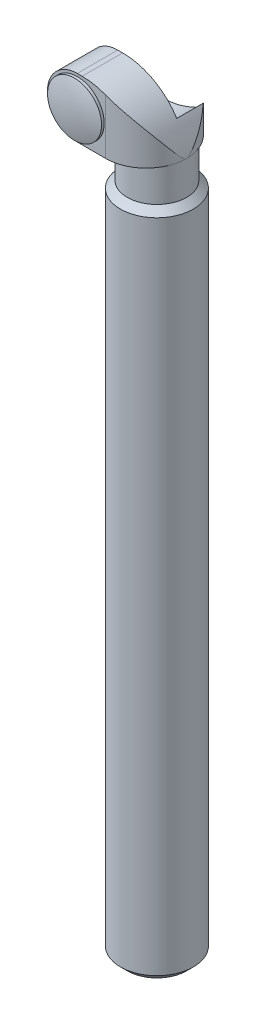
ISO-10303-21;
HEADER;
FILE_DESCRIPTION(('STEP AP214'),'2;1');
FILE_NAME('part.step','',(''),(''),'','','');
FILE_SCHEMA(('AUTOMOTIVE_DESIGN { 1 0 10303 214 1 1 1 1 }'));
ENDSEC;
DATA;
#1=APPLICATION_CONTEXT('core data for automotive mechanical design processes');
#2=APPLICATION_PROTOCOL_DEFINITION('international standard','automotive_design',2000,#1);
#3=PRODUCT_CONTEXT('',#1,'mechanical');
#4=PRODUCT('Part','Part','',(#3));
#5=PRODUCT_RELATED_PRODUCT_CATEGORY('part','',(#4));
#6=PRODUCT_DEFINITION_FORMATION('','',#4);
#7=PRODUCT_DEFINITION_CONTEXT('part definition',#1,'design');
#8=PRODUCT_DEFINITION('design','',#6,#7);
#9=PRODUCT_DEFINITION_SHAPE('','',#8);
#10=(LENGTH_UNIT() NAMED_UNIT(*) SI_UNIT(.MILLI.,.METRE.));
#11=(NAMED_UNIT(*) PLANE_ANGLE_UNIT() SI_UNIT($,.RADIAN.));
#12=(NAMED_UNIT(*) SI_UNIT($,.STERADIAN.) SOLID_ANGLE_UNIT());
#13=UNCERTAINTY_MEASURE_WITH_UNIT(LENGTH_MEASURE(1.E-05),#10,'distance_accuracy_value','');
#14=(GEOMETRIC_REPRESENTATION_CONTEXT(3) GLOBAL_UNCERTAINTY_ASSIGNED_CONTEXT((#13)) GLOBAL_UNIT_ASSIGNED_CONTEXT((#10,
#11,#12)) REPRESENTATION_CONTEXT('',''));
#15=CARTESIAN_POINT('',(0.,0.,0.));
#16=DIRECTION('',(0.,0.,1.));
#17=DIRECTION('',(1.,0.,0.));
#18=AXIS2_PLACEMENT_3D('',#15,#16,#17);
#19=CARTESIAN_POINT('',(-29.,0.,30.));
#20=DIRECTION('',(0.,0.,1.));
#21=DIRECTION('',(1.,0.,0.));
#22=AXIS2_PLACEMENT_3D('',#19,#20,#21);
#23=PLANE('',#22);
#24=DIRECTION('',(0.,1.,0.));
#25=VECTOR('',#24,1.);
#26=CARTESIAN_POINT('',(-8.,-22.,30.));
#27=LINE('',#26,#25);
#28=CARTESIAN_POINT('',(-8.,-22.,30.));
#29=VERTEX_POINT('',#28);
#30=CARTESIAN_POINT('',(-7.99999999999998,18.7097571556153,30.));
#31=VERTEX_POINT('',#30);
#32=EDGE_CURVE('E175',#29,#31,#27,.T.);
#33=ORIENTED_EDGE('',*,*,#32,.T.);
#34=CARTESIAN_POINT('',(-25.370877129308,-25.5,30.));
#35=DIRECTION('',(0.,0.,1.));
#36=DIRECTION('',(-1.,0.,0.));
#37=AXIS2_PLACEMENT_3D('',#34,#35,#36);
#38=CIRCLE('',#37,47.5);
#39=CARTESIAN_POINT('',(-25.370877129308,22.,30.));
#40=VERTEX_POINT('',#39);
#41=EDGE_CURVE('E200',#31,#40,#38,.T.);
#42=ORIENTED_EDGE('',*,*,#41,.T.);
#43=DIRECTION('',(-1.,0.,0.));
#44=VECTOR('',#43,1.);
#45=CARTESIAN_POINT('',(-29.,22.,30.));
#46=LINE('',#45,#44);
#47=CARTESIAN_POINT('',(-29.,22.,30.));
#48=VERTEX_POINT('',#47);
#49=EDGE_CURVE('E118',#40,#48,#46,.T.);
#50=ORIENTED_EDGE('',*,*,#49,.T.);
#51=CARTESIAN_POINT('',(-29.,0.,30.));
#52=DIRECTION('',(0.,0.,1.));
#53=DIRECTION('',(1.,0.,0.));
#54=AXIS2_PLACEMENT_3D('',#51,#52,#53);
#55=CIRCLE('',#54,22.);
#56=CARTESIAN_POINT('',(-29.,-22.,30.));
#57=VERTEX_POINT('',#56);
#58=EDGE_CURVE('E194',#48,#57,#55,.T.);
#59=ORIENTED_EDGE('',*,*,#58,.T.);
#60=DIRECTION('',(1.,0.,0.));
#61=VECTOR('',#60,1.);
#62=CARTESIAN_POINT('',(-29.,-22.,30.));
#63=LINE('',#62,#61);
#64=EDGE_CURVE('E197',#57,#29,#63,.T.);
#65=ORIENTED_EDGE('',*,*,#64,.T.);
#66=EDGE_LOOP('',(#33,#42,#50,#59,#65));
#67=FACE_BOUND('',#66,.T.);
#68=CARTESIAN_POINT('',(-29.,0.,30.));
#69=DIRECTION('',(0.,0.,1.));
#70=DIRECTION('',(1.,0.,0.));
#71=AXIS2_PLACEMENT_3D('',#68,#69,#70);
#72=CIRCLE('',#71,20.);
#73=CARTESIAN_POINT('',(-8.99999999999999,0.,30.));
#74=VERTEX_POINT('',#73);
#75=EDGE_CURVE('E227',#74,#74,#72,.T.);
#76=ORIENTED_EDGE('',*,*,#75,.F.);
#77=EDGE_LOOP('',(#76));
#78=FACE_BOUND('',#77,.T.);
#79=ADVANCED_FACE('F32',(#67,#78),#23,.T.);
#80=CARTESIAN_POINT('',(-29.,-22.,30.));
#81=DIRECTION('',(0.,1.,0.));
#82=DIRECTION('',(-1.,0.,0.));
#83=AXIS2_PLACEMENT_3D('',#80,#81,#82);
#84=PLANE('',#83);
#85=DIRECTION('',(0.,0.,1.));
#86=VECTOR('',#85,1.);
#87=CARTESIAN_POINT('',(-25.370877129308,-22.,-30.));
#88=LINE('',#87,#86);
#89=CARTESIAN_POINT('',(-25.370877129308,-22.,-30.));
#90=VERTEX_POINT('',#89);
#91=CARTESIAN_POINT('',(-25.370877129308,-22.,0.));
#92=VERTEX_POINT('',#91);
#93=EDGE_CURVE('E218',#90,#92,#88,.T.);
#94=ORIENTED_EDGE('',*,*,#93,.F.);
#95=DIRECTION('',(1.,0.,0.));
#96=VECTOR('',#95,1.);
#97=CARTESIAN_POINT('',(-29.,-22.,-30.));
#98=LINE('',#97,#96);
#99=CARTESIAN_POINT('',(-7.99999999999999,-22.,-30.));
#100=VERTEX_POINT('',#99);
#101=EDGE_CURVE('E55',#90,#100,#98,.T.);
#102=ORIENTED_EDGE('',*,*,#101,.T.);
#103=CARTESIAN_POINT('',(-8.,-22.,0.));
#104=DIRECTION('',(0.,-1.,0.));
#105=DIRECTION('',(1.,0.,0.));
#106=AXIS2_PLACEMENT_3D('',#103,#104,#105);
#107=CIRCLE('',#106,30.);
#108=CARTESIAN_POINT('',(22.,-22.,0.));
#109=VERTEX_POINT('',#108);
#110=EDGE_CURVE('E209',#100,#109,#107,.T.);
#111=ORIENTED_EDGE('',*,*,#110,.T.);
#112=CARTESIAN_POINT('',(0.,-22.,0.));
#113=DIRECTION('',(0.,1.,0.));
#114=DIRECTION('',(-1.,0.,0.));
#115=AXIS2_PLACEMENT_3D('',#112,#113,#114);
#116=CIRCLE('',#115,22.);
#117=EDGE_CURVE('E178',#109,#109,#116,.T.);
#118=ORIENTED_EDGE('',*,*,#117,.T.);
#119=EDGE_CURVE('E207',#109,#29,#107,.T.);
#120=ORIENTED_EDGE('',*,*,#119,.T.);
#121=ORIENTED_EDGE('',*,*,#64,.F.);
#122=DIRECTION('',(0.,0.,-1.));
#123=VECTOR('',#122,1.);
#124=CARTESIAN_POINT('',(-29.,-22.,30.));
#125=LINE('',#124,#123);
#126=CARTESIAN_POINT('',(-29.,-22.,0.));
#127=VERTEX_POINT('',#126);
#128=EDGE_CURVE('E41',#57,#127,#125,.T.);
#129=ORIENTED_EDGE('',*,*,#128,.T.);
#130=DIRECTION('',(1.,0.,0.));
#131=VECTOR('',#130,1.);
#132=CARTESIAN_POINT('',(-29.,-22.,0.));
#133=LINE('',#132,#131);
#134=EDGE_CURVE('E205',#127,#92,#133,.T.);
#135=ORIENTED_EDGE('',*,*,#134,.T.);
#136=EDGE_LOOP('',(#94,#102,#111,#118,#120,#121,#129,#135));
#137=FACE_BOUND('',#136,.T.);
#138=ADVANCED_FACE('F149',(#137),#84,.F.);
#139=CARTESIAN_POINT('',(-29.,0.,30.));
#140=DIRECTION('',(0.,0.,-1.));
#141=DIRECTION('',(-1.,0.,0.));
#142=AXIS2_PLACEMENT_3D('',#139,#140,#141);
#143=CYLINDRICAL_SURFACE('',#142,22.);
#144=DIRECTION('',(0.,0.,-1.));
#145=VECTOR('',#144,1.);
#146=CARTESIAN_POINT('',(-29.,22.,30.));
#147=LINE('',#146,#145);
#148=CARTESIAN_POINT('',(-29.,22.,0.));
#149=VERTEX_POINT('',#148);
#150=EDGE_CURVE('E119',#48,#149,#147,.T.);
#151=ORIENTED_EDGE('',*,*,#150,.T.);
#152=CARTESIAN_POINT('',(-29.,0.,0.));
#153=DIRECTION('',(0.,0.,1.));
#154=DIRECTION('',(1.,0.,0.));
#155=AXIS2_PLACEMENT_3D('',#152,#153,#154);
#156=CIRCLE('',#155,22.);
#157=EDGE_CURVE('E101',#149,#127,#156,.T.);
#158=ORIENTED_EDGE('',*,*,#157,.T.);
#159=ORIENTED_EDGE('',*,*,#128,.F.);
#160=ORIENTED_EDGE('',*,*,#58,.F.);
#161=EDGE_LOOP('',(#151,#158,#159,#160));
#162=FACE_BOUND('',#161,.T.);
#163=ADVANCED_FACE('F155',(#162),#143,.T.);
#164=CARTESIAN_POINT('',(-25.370877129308,-25.5,30.));
#165=DIRECTION('',(0.,0.,-1.));
#166=DIRECTION('',(-1.,0.,0.));
#167=AXIS2_PLACEMENT_3D('',#164,#165,#166);
#168=CYLINDRICAL_SURFACE('',#167,47.5);
#169=CARTESIAN_POINT('',(-7.99999999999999,18.7097571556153,30.));
#170=CARTESIAN_POINT('',(-7.56651433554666,18.5394487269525,30.0000097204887));
#171=CARTESIAN_POINT('',(-7.1355781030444,18.362749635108,29.990605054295));
#172=CARTESIAN_POINT('',(-6.27980889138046,17.9970941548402,29.9537005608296));
#173=CARTESIAN_POINT('',(-5.85497483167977,17.8081399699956,29.9262039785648));
#174=CARTESIAN_POINT('',(-5.01290872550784,17.4187377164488,29.8539045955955));
#175=CARTESIAN_POINT('',(-4.59566595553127,17.2183078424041,29.8091285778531));
#176=CARTESIAN_POINT('',(-3.76890543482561,16.8062437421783,29.7030569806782));
#177=CARTESIAN_POINT('',(-3.35938802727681,16.5946090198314,29.6417606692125));
#178=CARTESIAN_POINT('',(-2.15202468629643,15.9483015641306,29.4357404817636));
#179=CARTESIAN_POINT('',(-1.36627834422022,15.4980098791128,29.268070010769));
#180=CARTESIAN_POINT('',(0.168412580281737,14.5600132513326,28.8774098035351));
#181=CARTESIAN_POINT('',(0.917338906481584,14.0722900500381,28.6543929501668));
#182=CARTESIAN_POINT('',(2.5531621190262,12.9410274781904,28.0988857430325));
#183=CARTESIAN_POINT('',(3.42927347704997,12.2884563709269,27.7529618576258));
#184=CARTESIAN_POINT('',(5.11749358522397,10.9400505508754,26.9960676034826));
#185=CARTESIAN_POINT('',(5.92959315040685,10.2442096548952,26.5850879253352));
#186=CARTESIAN_POINT('',(7.49285473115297,8.81259008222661,25.705633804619));
#187=CARTESIAN_POINT('',(8.24369978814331,8.07663296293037,25.2368883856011));
#188=CARTESIAN_POINT('',(9.68040760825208,6.57395304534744,24.2520491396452));
#189=CARTESIAN_POINT('',(10.3662666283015,5.80722847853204,23.7359525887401));
#190=CARTESIAN_POINT('',(11.9300216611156,3.94309939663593,22.453913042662));
#191=CARTESIAN_POINT('',(12.7782202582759,2.83356125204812,21.6691497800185));
#192=CARTESIAN_POINT('',(13.9610019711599,1.14071491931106,20.4459341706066));
#193=CARTESIAN_POINT('',(14.3404573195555,0.571477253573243,20.0303675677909));
#194=CARTESIAN_POINT('',(15.0701504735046,-0.575410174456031,19.1854034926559));
#195=CARTESIAN_POINT('',(15.420388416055,-1.15305989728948,18.7560060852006));
#196=CARTESIAN_POINT('',(16.4271284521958,-2.89526047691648,17.4505721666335));
#197=CARTESIAN_POINT('',(17.0409444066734,-4.0709185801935,16.5559483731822));
#198=CARTESIAN_POINT('',(17.8788126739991,-5.84946117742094,15.1846539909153));
#199=CARTESIAN_POINT('',(18.1442648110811,-6.44474259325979,14.722722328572));
#200=CARTESIAN_POINT('',(18.6481619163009,-7.63958107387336,13.7897254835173));
#201=CARTESIAN_POINT('',(18.8866076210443,-8.23913802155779,13.3186605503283));
#202=CARTESIAN_POINT('',(19.4348396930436,-9.70297471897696,12.1613875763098));
#203=CARTESIAN_POINT('',(19.7305689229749,-10.5690135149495,11.4706872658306));
#204=CARTESIAN_POINT('',(20.1339114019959,-11.8702367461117,10.4222411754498));
#205=CARTESIAN_POINT('',(20.2616448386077,-12.3043164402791,10.070711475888));
#206=CARTESIAN_POINT('',(20.5038360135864,-13.1726366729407,9.36328408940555));
#207=CARTESIAN_POINT('',(20.6182936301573,-13.606877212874,9.00738636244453));
#208=CARTESIAN_POINT('',(20.8756491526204,-14.642172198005,8.15267084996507));
#209=CARTESIAN_POINT('',(21.0124862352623,-15.2429587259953,7.65168036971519));
#210=CARTESIAN_POINT('',(21.1987780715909,-16.1399604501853,6.89195452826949));
#211=CARTESIAN_POINT('',(21.2576644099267,-16.4379635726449,6.63760221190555));
#212=CARTESIAN_POINT('',(21.3691969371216,-17.0320158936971,6.12527867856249));
#213=CARTESIAN_POINT('',(21.4218433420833,-17.3280651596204,5.86730758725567));
#214=CARTESIAN_POINT('',(21.5346196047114,-17.9986796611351,5.27454582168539));
#215=CARTESIAN_POINT('',(21.5927807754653,-18.3722699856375,4.93827638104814));
#216=CARTESIAN_POINT('',(21.6992110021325,-19.1127530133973,4.25192076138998));
#217=CARTESIAN_POINT('',(21.747413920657,-19.4795870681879,3.90175953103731));
#218=CARTESIAN_POINT('',(21.8119658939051,-20.0170583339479,3.35860630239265));
#219=CARTESIAN_POINT('',(21.832286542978,-20.1950858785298,3.17343622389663));
#220=CARTESIAN_POINT('',(21.8701342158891,-20.5434422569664,2.794893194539));
#221=CARTESIAN_POINT('',(21.8876555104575,-20.7137548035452,2.60150442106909));
#222=CARTESIAN_POINT('',(21.9194864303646,-21.0392872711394,2.20534221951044));
#223=CARTESIAN_POINT('',(21.9338268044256,-21.1946426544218,2.00268376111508));
#224=CARTESIAN_POINT('',(21.9590429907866,-21.4814199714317,1.5811895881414));
#225=CARTESIAN_POINT('',(21.9699344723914,-21.6129489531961,1.36243277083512));
#226=CARTESIAN_POINT('',(21.9837749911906,-21.7863358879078,0.995881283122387));
#227=CARTESIAN_POINT('',(21.9881533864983,-21.8429202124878,0.85533096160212));
#228=CARTESIAN_POINT('',(21.9949833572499,-21.9324673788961,0.567099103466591));
#229=CARTESIAN_POINT('',(21.9974427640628,-21.9655261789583,0.419449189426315));
#230=CARTESIAN_POINT('',(22.0001466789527,-22.0019239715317,0.118381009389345));
#231=CARTESIAN_POINT('',(22.0003631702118,-22.0048870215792,-0.0350862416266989));
#232=CARTESIAN_POINT('',(21.9984675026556,-21.9793046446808,-0.339504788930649));
#233=CARTESIAN_POINT('',(21.9963500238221,-21.9506872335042,-0.490449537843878));
#234=CARTESIAN_POINT('',(21.9893426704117,-21.8582881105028,-0.820270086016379));
#235=CARTESIAN_POINT('',(21.9839083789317,-21.787703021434,-0.997129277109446));
#236=CARTESIAN_POINT('',(21.9706034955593,-21.6216987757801,-1.33878747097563));
#237=CARTESIAN_POINT('',(21.9627231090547,-21.5261800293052,-1.50353463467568));
#238=CARTESIAN_POINT('',(21.9384457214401,-21.2444524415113,-1.9409122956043));
#239=CARTESIAN_POINT('',(21.9200528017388,-21.0432950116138,-2.20354789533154));
#240=CARTESIAN_POINT('',(21.8782979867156,-20.6202954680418,-2.7114537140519));
#241=CARTESIAN_POINT('',(21.8549210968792,-20.3983920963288,-2.95666848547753));
#242=CARTESIAN_POINT('',(21.8034022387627,-19.942088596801,-3.43742704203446));
#243=CARTESIAN_POINT('',(21.7752327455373,-19.7076219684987,-3.67290460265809));
#244=CARTESIAN_POINT('',(21.7144260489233,-19.2324943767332,-4.13609641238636));
#245=CARTESIAN_POINT('',(21.681795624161,-18.9918432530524,-4.36382179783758));
#246=CARTESIAN_POINT('',(21.6124179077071,-18.5086468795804,-4.81202947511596));
#247=CARTESIAN_POINT('',(21.5757114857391,-18.2661397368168,-5.03255927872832));
#248=CARTESIAN_POINT('',(21.4979657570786,-17.7784327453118,-5.46985268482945));
#249=CARTESIAN_POINT('',(21.4569262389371,-17.5332327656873,-5.68661610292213));
#250=CARTESIAN_POINT('',(21.327307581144,-16.7948813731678,-6.33263325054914));
#251=CARTESIAN_POINT('',(21.23223937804,-16.2990559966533,-6.75754322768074));
#252=CARTESIAN_POINT('',(21.0246500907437,-15.3037208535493,-7.59985308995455));
#253=CARTESIAN_POINT('',(20.912108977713,-14.8042074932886,-8.01724373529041));
#254=CARTESIAN_POINT('',(20.6695491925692,-13.8041083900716,-8.84551530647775));
#255=CARTESIAN_POINT('',(20.5395321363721,-13.3035227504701,-9.25639683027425));
#256=CARTESIAN_POINT('',(20.2622292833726,-12.3038653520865,-10.0713009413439));
#257=CARTESIAN_POINT('',(20.1149904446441,-11.8047931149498,-10.475338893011));
#258=CARTESIAN_POINT('',(19.8027933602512,-10.8077420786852,-11.2778552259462));
#259=CARTESIAN_POINT('',(19.6378348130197,-10.3097632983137,-11.6763335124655));
#260=CARTESIAN_POINT('',(19.1161909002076,-8.81890038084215,-12.8630936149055));
#261=CARTESIAN_POINT('',(18.7326056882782,-7.82861250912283,-13.6430884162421));
#262=CARTESIAN_POINT('',(18.0501654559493,-6.23063019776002,-14.8891363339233));
#263=CARTESIAN_POINT('',(17.7737582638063,-5.61921982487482,-15.3628563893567));
#264=CARTESIAN_POINT('',(17.1918194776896,-4.40208764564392,-16.2995801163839));
#265=CARTESIAN_POINT('',(16.8862869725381,-3.79636601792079,-16.7625834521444));
#266=CARTESIAN_POINT('',(15.9248222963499,-1.98875820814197,-18.1342348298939));
#267=CARTESIAN_POINT('',(15.22413502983,-0.796693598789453,-19.025317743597));
#268=CARTESIAN_POINT('',(14.080666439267,0.963467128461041,-20.3168513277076));
#269=CARTESIAN_POINT('',(13.6841269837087,1.54550179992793,-20.7398265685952));
#270=CARTESIAN_POINT('',(12.8595257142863,2.69909858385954,-21.569009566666));
#271=CARTESIAN_POINT('',(12.4314626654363,3.27066028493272,-21.9752166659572));
#272=CARTESIAN_POINT('',(11.0995658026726,4.9667297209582,-23.1651360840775));
#273=CARTESIAN_POINT('',(10.1472862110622,6.07376735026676,-23.9209907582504));
#274=CARTESIAN_POINT('',(8.51158018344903,7.80220969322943,-25.0586057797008));
#275=CARTESIAN_POINT('',(7.8696604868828,8.44341721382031,-25.4706040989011));
#276=CARTESIAN_POINT('',(6.53680472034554,9.69925774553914,-26.2541179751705));
#277=CARTESIAN_POINT('',(5.84587424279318,10.3138937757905,-26.6256381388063));
#278=CARTESIAN_POINT('',(4.41787795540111,11.5100596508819,-27.3207734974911));
#279=CARTESIAN_POINT('',(3.68098884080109,12.0917016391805,-27.6445577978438));
#280=CARTESIAN_POINT('',(2.15994560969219,13.2194989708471,-28.2390138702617));
#281=CARTESIAN_POINT('',(1.37579569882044,13.7656574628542,-28.509690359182));
#282=CARTESIAN_POINT('',(-0.0893003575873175,14.7207704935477,-28.9463868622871));
#283=CARTESIAN_POINT('',(-0.762822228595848,15.1365259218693,-29.1224958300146));
#284=CARTESIAN_POINT('',(-2.13742470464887,15.9377707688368,-29.4300145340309));
#285=CARTESIAN_POINT('',(-2.83849538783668,16.3232709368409,-29.561440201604));
#286=CARTESIAN_POINT('',(-3.91114854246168,16.8779901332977,-29.7222730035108));
#287=CARTESIAN_POINT('',(-4.27368781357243,17.0596477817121,-29.7699489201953));
#288=CARTESIAN_POINT('',(-5.00450980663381,17.4141696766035,-29.8523403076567));
#289=CARTESIAN_POINT('',(-5.37279235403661,17.5870341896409,-29.887056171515));
#290=CARTESIAN_POINT('',(-6.11493402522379,17.9237818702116,-29.9430314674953));
#291=CARTESIAN_POINT('',(-6.48879872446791,18.0876551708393,-29.964276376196));
#292=CARTESIAN_POINT('',(-7.24112326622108,18.4059118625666,-29.9927644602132));
#293=CARTESIAN_POINT('',(-7.61958365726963,18.5602941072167,-30.0000059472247));
#294=CARTESIAN_POINT('',(-7.99999999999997,18.7097571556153,-30.));
#295=B_SPLINE_CURVE_WITH_KNOTS('',3,(#169,#170,#171,#172,#173,#174,#175,#176,#177,#178,#179,
#180,#181,#182,#183,#184,#185,#186,#187,#188,#189,#190,#191,#192,#193,#194,#195,#196,#197,#198,
#199,#200,#201,#202,#203,#204,#205,#206,#207,#208,#209,#210,#211,#212,#213,#214,#215,#216,#217,
#218,#219,#220,#221,#222,#223,#224,#225,#226,#227,#228,#229,#230,#231,#232,#233,#234,#235,#236,
#237,#238,#239,#240,#241,#242,#243,#244,#245,#246,#247,#248,#249,#250,#251,#252,#253,#254,#255,
#256,#257,#258,#259,#260,#261,#262,#263,#264,#265,#266,#267,#268,#269,#270,#271,#272,#273,#274,
#275,#276,#277,#278,#279,#280,#281,#282,#283,#284,#285,#286,#287,#288,#289,#290,#291,#292,#293,
#294),.UNSPECIFIED.,.F.,.F.,(4,2,2,2,2,2,2,2,2,2,2,2,2,2,2,2,2,2,2,2,2,2,2,2,2,2,2,2,2,2,2,2,2,
2,2,2,2,2,2,2,2,2,2,2,2,2,2,2,2,2,2,2,2,2,2,2,2,2,2,2,2,2,4),(0.,1.39702311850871,
2.79379573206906,4.18841200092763,5.58309007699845,8.34239851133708,11.1030615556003,
14.5356517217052,17.9687335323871,21.4185809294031,24.8686269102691,29.6669298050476,
32.0677195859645,34.4684981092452,39.2621903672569,41.6584374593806,44.0546191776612,
47.4926192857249,49.2114437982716,50.9302840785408,53.3121675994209,54.5006931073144,
55.6891774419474,57.2069868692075,58.7345738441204,59.5074392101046,60.2818666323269,
61.048445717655,61.8114903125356,62.2647675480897,62.7161851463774,63.1732348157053,
63.6313284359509,64.1996278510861,64.7702328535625,65.7614555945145,66.7557036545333,
67.7558675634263,68.7545282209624,69.7439519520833,70.7334239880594,72.712684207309,
74.6942301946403,76.6755930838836,78.6516741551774,80.627788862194,84.5781346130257,
87.0416653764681,89.5052732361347,94.4335475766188,96.897428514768,99.3614060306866,
104.284569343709,107.272032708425,110.259155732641,113.235428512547,116.211436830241,
118.64202426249,121.071744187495,122.296357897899,123.520934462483,124.746829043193,
125.972871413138),.UNSPECIFIED.);
#296=CARTESIAN_POINT('',(14.7040526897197,0.,-19.609334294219));
#297=VERTEX_POINT('',#296);
#298=EDGE_CURVE('E168',#109,#297,#295,.T.);
#299=ORIENTED_EDGE('',*,*,#298,.T.);
#300=DIRECTION('',(0.,0.,1.));
#301=VECTOR('',#300,1.);
#302=CARTESIAN_POINT('',(14.7040526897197,0.,-30.));
#303=LINE('',#302,#301);
#304=CARTESIAN_POINT('',(14.7040526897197,0.,0.));
#305=VERTEX_POINT('',#304);
#306=EDGE_CURVE('E48',#297,#305,#303,.T.);
#307=ORIENTED_EDGE('',*,*,#306,.T.);
#308=CARTESIAN_POINT('',(-25.370877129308,-25.5,0.));
#309=DIRECTION('',(0.,0.,1.));
#310=DIRECTION('',(1.,0.,0.));
#311=AXIS2_PLACEMENT_3D('',#308,#309,#310);
#312=CIRCLE('',#311,47.5);
#313=CARTESIAN_POINT('',(-25.370877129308,22.,0.));
#314=VERTEX_POINT('',#313);
#315=EDGE_CURVE('E99',#305,#314,#312,.T.);
#316=ORIENTED_EDGE('',*,*,#315,.T.);
#317=DIRECTION('',(0.,0.,-1.));
#318=VECTOR('',#317,1.);
#319=CARTESIAN_POINT('',(-25.370877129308,22.,30.));
#320=LINE('',#319,#318);
#321=EDGE_CURVE('E112',#40,#314,#320,.T.);
#322=ORIENTED_EDGE('',*,*,#321,.F.);
#323=ORIENTED_EDGE('',*,*,#41,.F.);
#324=EDGE_CURVE('E174',#31,#109,#295,.T.);
#325=ORIENTED_EDGE('',*,*,#324,.T.);
#326=EDGE_LOOP('',(#299,#307,#316,#322,#323,#325));
#327=FACE_BOUND('',#326,.T.);
#328=ADVANCED_FACE('F110',(#327),#168,.T.);
#329=CARTESIAN_POINT('',(-29.,22.,30.));
#330=DIRECTION('',(0.,-1.,0.));
#331=DIRECTION('',(0.,0.,-1.));
#332=AXIS2_PLACEMENT_3D('',#329,#330,#331);
#333=PLANE('',#332);
#334=ORIENTED_EDGE('',*,*,#321,.T.);
#335=DIRECTION('',(-1.,0.,0.));
#336=VECTOR('',#335,1.);
#337=CARTESIAN_POINT('',(-25.370877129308,22.,0.));
#338=LINE('',#337,#336);
#339=EDGE_CURVE('E96',#314,#149,#338,.T.);
#340=ORIENTED_EDGE('',*,*,#339,.T.);
#341=ORIENTED_EDGE('',*,*,#150,.F.);
#342=ORIENTED_EDGE('',*,*,#49,.F.);
#343=EDGE_LOOP('',(#334,#340,#341,#342));
#344=FACE_BOUND('',#343,.T.);
#345=ADVANCED_FACE('F117',(#344),#333,.F.);
#346=CARTESIAN_POINT('',(-29.,0.,-30.));
#347=DIRECTION('',(0.,0.,1.));
#348=DIRECTION('',(1.,0.,0.));
#349=AXIS2_PLACEMENT_3D('',#346,#347,#348);
#350=PLANE('',#349);
#351=ORIENTED_EDGE('',*,*,#101,.F.);
#352=CARTESIAN_POINT('',(-25.370877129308,25.5,-30.));
#353=DIRECTION('',(0.,0.,1.));
#354=DIRECTION('',(-1.,0.,0.));
#355=AXIS2_PLACEMENT_3D('',#352,#353,#354);
#356=CIRCLE('',#355,47.5);
#357=CARTESIAN_POINT('',(-8.,-18.7097571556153,-30.));
#358=VERTEX_POINT('',#357);
#359=EDGE_CURVE('E114',#90,#358,#356,.T.);
#360=ORIENTED_EDGE('',*,*,#359,.T.);
#361=DIRECTION('',(0.,1.,0.));
#362=VECTOR('',#361,1.);
#363=CARTESIAN_POINT('',(-8.00000000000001,-22.,-30.));
#364=LINE('',#363,#362);
#365=EDGE_CURVE('E176',#100,#358,#364,.T.);
#366=ORIENTED_EDGE('',*,*,#365,.F.);
#367=EDGE_LOOP('',(#351,#360,#366));
#368=FACE_BOUND('',#367,.T.);
#369=ADVANCED_FACE('F161',(#368),#350,.F.);
#370=CARTESIAN_POINT('',(22.0000000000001,-543.,0.));
#371=DIRECTION('',(0.,1.,0.));
#372=DIRECTION('',(-1.,0.,0.));
#373=AXIS2_PLACEMENT_3D('',#370,#371,#372);
#374=PLANE('',#373);
#375=CARTESIAN_POINT('',(0.,-543.,0.));
#376=DIRECTION('',(0.,1.,0.));
#377=DIRECTION('',(-1.,0.,0.));
#378=AXIS2_PLACEMENT_3D('',#375,#376,#377);
#379=CIRCLE('',#378,22.);
#380=CARTESIAN_POINT('',(-21.9999999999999,-543.,0.));
#381=VERTEX_POINT('',#380);
#382=EDGE_CURVE('E190',#381,#381,#379,.T.);
#383=ORIENTED_EDGE('',*,*,#382,.F.);
#384=EDGE_LOOP('',(#383));
#385=FACE_BOUND('',#384,.T.);
#386=ADVANCED_FACE('F254',(#385),#374,.F.);
#387=CARTESIAN_POINT('',(0.,-543.,0.));
#388=DIRECTION('',(0.,1.,0.));
#389=DIRECTION('',(-1.,0.,0.));
#390=AXIS2_PLACEMENT_3D('',#387,#388,#389);
#391=CONICAL_SURFACE('',#390,22.,0.785398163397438);
#392=CARTESIAN_POINT('',(0.,-538.,0.));
#393=DIRECTION('',(0.,1.,0.));
#394=DIRECTION('',(-1.,0.,0.));
#395=AXIS2_PLACEMENT_3D('',#392,#393,#394);
#396=CIRCLE('',#395,27.);
#397=CARTESIAN_POINT('',(-26.9999999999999,-538.,0.));
#398=VERTEX_POINT('',#397);
#399=EDGE_CURVE('E187',#398,#398,#396,.T.);
#400=ORIENTED_EDGE('',*,*,#399,.F.);
#401=EDGE_LOOP('',(#400));
#402=FACE_BOUND('',#401,.T.);
#403=ORIENTED_EDGE('',*,*,#382,.T.);
#404=EDGE_LOOP('',(#403));
#405=FACE_BOUND('',#404,.T.);
#406=ADVANCED_FACE('F251',(#402,#405),#391,.T.);
#407=CARTESIAN_POINT('',(0.,22.74636757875,0.));
#408=DIRECTION('',(0.,1.,0.));
#409=DIRECTION('',(-1.,0.,0.));
#410=AXIS2_PLACEMENT_3D('',#407,#408,#409);
#411=CYLINDRICAL_SURFACE('',#410,27.);
#412=CARTESIAN_POINT('',(0.,-52.,0.));
#413=DIRECTION('',(0.,1.,0.));
#414=DIRECTION('',(-1.,0.,0.));
#415=AXIS2_PLACEMENT_3D('',#412,#413,#414);
#416=CIRCLE('',#415,27.);
#417=CARTESIAN_POINT('',(-27.,-52.,0.));
#418=VERTEX_POINT('',#417);
#419=EDGE_CURVE('E184',#418,#418,#416,.T.);
#420=ORIENTED_EDGE('',*,*,#419,.F.);
#421=EDGE_LOOP('',(#420));
#422=FACE_BOUND('',#421,.T.);
#423=ORIENTED_EDGE('',*,*,#399,.T.);
#424=EDGE_LOOP('',(#423));
#425=FACE_BOUND('',#424,.T.);
#426=ADVANCED_FACE('F244',(#422,#425),#411,.T.);
#427=CARTESIAN_POINT('',(0.,-52.,0.));
#428=DIRECTION('',(0.,-1.,0.));
#429=DIRECTION('',(1.,0.,0.));
#430=AXIS2_PLACEMENT_3D('',#427,#428,#429);
#431=CONICAL_SURFACE('',#430,27.,0.785398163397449);
#432=CARTESIAN_POINT('',(0.,-47.,0.));
#433=DIRECTION('',(0.,1.,0.));
#434=DIRECTION('',(-1.,0.,0.));
#435=AXIS2_PLACEMENT_3D('',#432,#433,#434);
#436=CIRCLE('',#435,22.);
#437=CARTESIAN_POINT('',(-22.,-47.,0.));
#438=VERTEX_POINT('',#437);
#439=EDGE_CURVE('E181',#438,#438,#436,.T.);
#440=ORIENTED_EDGE('',*,*,#439,.F.);
#441=EDGE_LOOP('',(#440));
#442=FACE_BOUND('',#441,.T.);
#443=ORIENTED_EDGE('',*,*,#419,.T.);
#444=EDGE_LOOP('',(#443));
#445=FACE_BOUND('',#444,.T.);
#446=ADVANCED_FACE('F239',(#442,#445),#431,.T.);
#447=CARTESIAN_POINT('',(0.,22.74636757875,0.));
#448=DIRECTION('',(0.,1.,0.));
#449=DIRECTION('',(-1.,0.,0.));
#450=AXIS2_PLACEMENT_3D('',#447,#448,#449);
#451=CYLINDRICAL_SURFACE('',#450,22.);
#452=ORIENTED_EDGE('',*,*,#117,.F.);
#453=EDGE_LOOP('',(#452));
#454=FACE_BOUND('',#453,.T.);
#455=ORIENTED_EDGE('',*,*,#439,.T.);
#456=EDGE_LOOP('',(#455));
#457=FACE_BOUND('',#456,.T.);
#458=ADVANCED_FACE('F234',(#454,#457),#451,.T.);
#459=CARTESIAN_POINT('',(-8.,-22.,0.));
#460=DIRECTION('',(0.,1.,0.));
#461=DIRECTION('',(-1.,0.,0.));
#462=AXIS2_PLACEMENT_3D('',#459,#460,#461);
#463=CYLINDRICAL_SURFACE('',#462,30.);
#464=ORIENTED_EDGE('',*,*,#365,.T.);
#465=CARTESIAN_POINT('',(-7.99999999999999,-18.7097571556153,-30.));
#466=CARTESIAN_POINT('',(-7.56658807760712,-18.5394776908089,-30.0000097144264));
#467=CARTESIAN_POINT('',(-7.13572470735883,-18.3628097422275,-29.9906082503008));
#468=CARTESIAN_POINT('',(-6.28009896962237,-17.9972206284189,-29.9537161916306));
#469=CARTESIAN_POINT('',(-5.85533552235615,-17.8083016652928,-29.9262288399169));
#470=CARTESIAN_POINT('',(-5.01339853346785,-17.4189693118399,-29.8539527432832));
#471=CARTESIAN_POINT('',(-4.59621442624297,-17.2185738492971,-29.8091903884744));
#472=CARTESIAN_POINT('',(-3.76956857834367,-16.8065816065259,-29.7031506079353));
#473=CARTESIAN_POINT('',(-3.36010718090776,-16.5949843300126,-29.6418724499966));
#474=CARTESIAN_POINT('',(-2.1526499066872,-15.9486553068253,-29.4358687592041));
#475=CARTESIAN_POINT('',(-1.36675984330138,-15.4982952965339,-29.2681829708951));
#476=CARTESIAN_POINT('',(0.168189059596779,-14.5601587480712,-28.8774763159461));
#477=CARTESIAN_POINT('',(0.917230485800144,-14.0723647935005,-28.6544295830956));
#478=CARTESIAN_POINT('',(2.55322538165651,-12.9409840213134,-28.0988644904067));
#479=CARTESIAN_POINT('',(3.42939449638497,-12.288367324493,-27.7529149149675));
#480=CARTESIAN_POINT('',(5.11779458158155,-10.9398025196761,-26.9959253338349));
#481=CARTESIAN_POINT('',(5.93001137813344,-10.2438448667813,-26.584870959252));
#482=CARTESIAN_POINT('',(7.4933750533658,-8.81209525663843,-25.7053226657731));
#483=CARTESIAN_POINT('',(8.24421177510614,-8.07612894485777,-25.2365638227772));
#484=CARTESIAN_POINT('',(9.68079322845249,-6.57351821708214,-24.2517583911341));
#485=CARTESIAN_POINT('',(10.3665535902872,-5.80688123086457,-23.7357232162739));
#486=CARTESIAN_POINT('',(11.3627329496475,-4.61935852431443,-22.9189997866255));
#487=CARTESIAN_POINT('',(11.6963563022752,-4.20770924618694,-22.6328084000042));
#488=CARTESIAN_POINT('',(12.3463032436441,-3.37805226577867,-22.050358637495));
#489=CARTESIAN_POINT('',(12.6626300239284,-2.96004575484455,-21.7541021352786));
#490=CARTESIAN_POINT('',(13.2759812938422,-2.12133751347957,-21.1545553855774));
#491=CARTESIAN_POINT('',(13.5731311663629,-1.70067853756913,-20.8513333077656));
#492=CARTESIAN_POINT('',(14.1509226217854,-0.854124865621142,-20.2364643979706));
#493=CARTESIAN_POINT('',(14.4315625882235,-0.428229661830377,-19.9248167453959));
#494=CARTESIAN_POINT('',(14.7040526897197,0.,-19.609334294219));
#495=B_SPLINE_CURVE_WITH_KNOTS('',3,(#465,#466,#467,#468,#469,#470,#471,#472,#473,#474,#475,
#476,#477,#478,#479,#480,#481,#482,#483,#484,#485,#486,#487,#488,#489,#490,#491,#492,#493,#494),
.UNSPECIFIED.,.F.,.F.,(4,2,2,2,2,2,2,2,2,2,2,2,2,2,4),(0.,1.39678554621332,2.79332071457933,
4.18773086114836,5.58220283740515,8.34198597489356,11.1030609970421,14.5358925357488,
17.9694827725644,21.4194698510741,24.868626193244,26.6749744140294,28.4809881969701,
30.2736537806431,32.0664945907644),.UNSPECIFIED.);
#496=EDGE_CURVE('E11',#358,#297,#495,.T.);
#497=ORIENTED_EDGE('',*,*,#496,.T.);
#498=ORIENTED_EDGE('',*,*,#298,.F.);
#499=ORIENTED_EDGE('',*,*,#110,.F.);
#500=EDGE_LOOP('',(#464,#497,#498,#499));
#501=FACE_BOUND('',#500,.T.);
#502=ADVANCED_FACE('F232',(#501),#463,.T.);
#503=ORIENTED_EDGE('',*,*,#324,.F.);
#504=ORIENTED_EDGE('',*,*,#32,.F.);
#505=ORIENTED_EDGE('',*,*,#119,.F.);
#506=EDGE_LOOP('',(#503,#504,#505));
#507=FACE_BOUND('',#506,.T.);
#508=ADVANCED_FACE('F130',(#507),#463,.T.);
#509=CARTESIAN_POINT('',(-25.370877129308,25.5,-30.));
#510=DIRECTION('',(0.,0.,1.));
#511=DIRECTION('',(1.,0.,0.));
#512=AXIS2_PLACEMENT_3D('',#509,#510,#511);
#513=CYLINDRICAL_SURFACE('',#512,47.5);
#514=ORIENTED_EDGE('',*,*,#359,.F.);
#515=ORIENTED_EDGE('',*,*,#93,.T.);
#516=CARTESIAN_POINT('',(-25.370877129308,25.5,0.));
#517=DIRECTION('',(0.,0.,1.));
#518=DIRECTION('',(-1.,0.,0.));
#519=AXIS2_PLACEMENT_3D('',#516,#517,#518);
#520=CIRCLE('',#519,47.5);
#521=EDGE_CURVE('E115',#92,#305,#520,.T.);
#522=ORIENTED_EDGE('',*,*,#521,.T.);
#523=ORIENTED_EDGE('',*,*,#306,.F.);
#524=ORIENTED_EDGE('',*,*,#496,.F.);
#525=EDGE_LOOP('',(#514,#515,#522,#523,#524));
#526=FACE_BOUND('',#525,.T.);
#527=ADVANCED_FACE('F133',(#526),#513,.F.);
#528=CARTESIAN_POINT('',(-25.370877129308,-25.5,0.));
#529=DIRECTION('',(0.,0.,1.));
#530=DIRECTION('',(1.,0.,0.));
#531=AXIS2_PLACEMENT_3D('',#528,#529,#530);
#532=PLANE('',#531);
#533=ORIENTED_EDGE('',*,*,#315,.F.);
#534=ORIENTED_EDGE('',*,*,#521,.F.);
#535=ORIENTED_EDGE('',*,*,#134,.F.);
#536=ORIENTED_EDGE('',*,*,#157,.F.);
#537=ORIENTED_EDGE('',*,*,#339,.F.);
#538=EDGE_LOOP('',(#533,#534,#535,#536,#537));
#539=FACE_BOUND('',#538,.T.);
#540=ADVANCED_FACE('F98',(#539),#532,.F.);
#541=CARTESIAN_POINT('',(-29.,0.,32.));
#542=DIRECTION('',(0.,0.,-1.));
#543=DIRECTION('',(-1.,0.,0.));
#544=AXIS2_PLACEMENT_3D('',#541,#542,#543);
#545=CYLINDRICAL_SURFACE('',#544,20.);
#546=CARTESIAN_POINT('',(-29.,0.,32.));
#547=DIRECTION('',(0.,0.,1.));
#548=DIRECTION('',(1.,0.,0.));
#549=AXIS2_PLACEMENT_3D('',#546,#547,#548);
#550=CIRCLE('',#549,20.);
#551=CARTESIAN_POINT('',(-8.99999999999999,0.,32.));
#552=VERTEX_POINT('',#551);
#553=EDGE_CURVE('E36',#552,#552,#550,.T.);
#554=ORIENTED_EDGE('',*,*,#553,.F.);
#555=EDGE_LOOP('',(#554));
#556=FACE_BOUND('',#555,.T.);
#557=ORIENTED_EDGE('',*,*,#75,.T.);
#558=EDGE_LOOP('',(#557));
#559=FACE_BOUND('',#558,.T.);
#560=ADVANCED_FACE('F139',(#556,#559),#545,.T.);
#561=CARTESIAN_POINT('',(-29.,0.,-33.1666666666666));
#562=DIRECTION('',(0.,0.,1.));
#563=DIRECTION('',(1.,0.,0.));
#564=AXIS2_PLACEMENT_3D('',#561,#562,#563);
#565=SPHERICAL_SURFACE('',#564,68.1666666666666);
#566=ORIENTED_EDGE('',*,*,#553,.T.);
#567=EDGE_LOOP('',(#566));
#568=FACE_BOUND('',#567,.T.);
#569=ADVANCED_FACE('F34',(#568),#565,.T.);
#570=CLOSED_SHELL('',(#79,#138,#163,#328,#345,#369,#386,#406,#426,#446,#458,#502,#508,#527,#540,
#560,#569));
#571=MANIFOLD_SOLID_BREP('B2',#570);
#572=ADVANCED_BREP_SHAPE_REPRESENTATION('',(#18,#571),#14);
#573=SHAPE_DEFINITION_REPRESENTATION(#9,#572);
ENDSEC;
END-ISO-10303-21;
